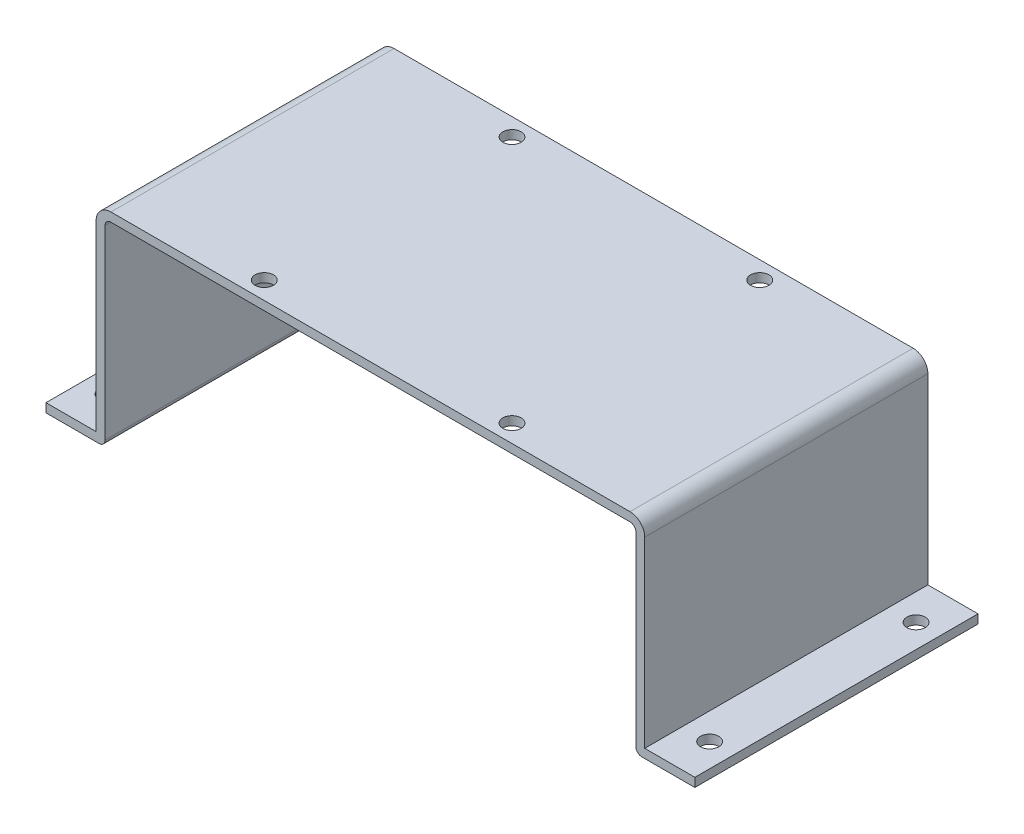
from build123d import *

# Parameters (mm, degrees)
EXTRUDE_1_DEPTH     = 24
SKETCH_3_R          = 1.55
CUT_EXTRUDE_1_DEPTH = 45


with BuildPart() as part:
    # Sketch 1 → Extrude 1 (new, symmetric)
    with BuildSketch(Plane.XY):
        with BuildLine():
            Line((-55, 0), (-46, 0))
            ThreePointArc((-46, 0), (-45.292893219, 0.292893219), (-45, 1))
            Line((-45, 1), (-45, 32.5))
            ThreePointArc((-45, 32.5), (-44.707106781, 33.207106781), (-44, 33.5))
            Line((-44, 33.5), (44, 33.5))
            ThreePointArc((44, 33.5), (44.707106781, 33.207106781), (45, 32.5))
            Line((45, 32.5), (45, 1))
            ThreePointArc((45, 1), (45.292893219, 0.292893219), (46, 0))
            Line((46, 0), (55, 0))
            Line((55, 0), (55, 1.5))
            Line((55, 1.5), (46.5, 1.5))
            Line((46.5, 1.5), (46.5, 32.5))
            ThreePointArc((46.5, 32.5), (45.767766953, 34.267766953), (44, 35))
            Line((44, 35), (-44, 35))
            ThreePointArc((-44, 35), (-45.767766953, 34.267766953), (-46.5, 32.5))
            Line((-46.5, 32.5), (-46.5, 1.5))
            Line((-46.5, 1.5), (-55, 1.5))
            Line((-55, 1.5), (-55, 0))
        make_face()
    extrude(amount=EXTRUDE_1_DEPTH, both=True)

    # Sketch 3 → Cut-Extrude 1 (cut)
    with BuildSketch(Plane(origin=(0, 35, 0), x_dir=(1, 0, 0), z_dir=(0, 1, 0))):
        with Locations(Location((-21, 21, 0), (0, 0, 180))):
            Circle(SKETCH_3_R)
        with Locations(Location((21, 21, 0), (0, 0, 180))):
            Circle(SKETCH_3_R)
        with Locations(Location((21, -21, 0), (0, 0, 180))):
            Circle(SKETCH_3_R)
        with Locations(Location((-21, -21, 0), (0, 0, 180))):
            Circle(SKETCH_3_R)
        with Locations((-51, 17.5)):
            Circle(SKETCH_3_R)
        with Locations((51, 17.5)):
            Circle(SKETCH_3_R)
        with Locations((-51, -17.5)):
            Circle(SKETCH_3_R)
        with Locations((51, -17.5)):
            Circle(SKETCH_3_R)
    extrude(amount=-CUT_EXTRUDE_1_DEPTH, mode=Mode.SUBTRACT)


solid = part.part
